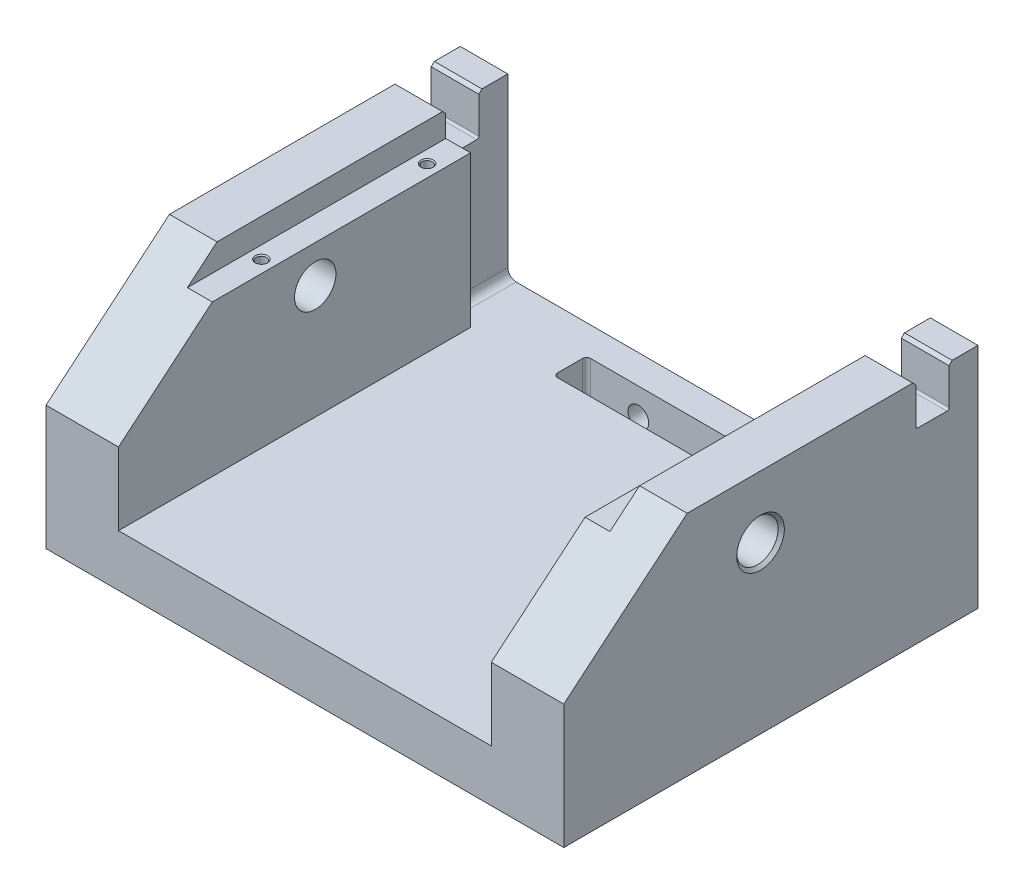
from build123d import *

# Parameters (mm, degrees)
BOSS_EXTRUDE1_DEPTH     = 100
CUT_EXTRUDE2_DEPTH      = 195.229245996
CUT_EXTRUDE2_DEPTH_BACK = 195.229245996
CUT_EXTRUDE3_DEPTH      = 195.229245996
CUT_EXTRUDE3_DEPTH_BACK = 195.229245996
SKETCH3_W               = 12
SKETCH3_H               = 12
SKETCH4_W               = 12
SKETCH4_H               = 30
CUT_EXTRUDE4_DEPTH      = 85
SKETCH5_W               = 23
SKETCH5_H               = 16
CUT_EXTRUDE5_DEPTH      = 20
SKETCH6_W               = 100
SKETCH6_H               = 16
CUT_EXTRUDE6_DEPTH      = 182.245689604
SKETCH8_R               = 2.5
CUT_EXTRUDE7_DEPTH      = 15
CHAMFER1_SIZE           = 0.5
SKETCH9_R               = 5
CUT_EXTRUDE8_DEPTH      = 40
FILLET1_R               = 1
FILLET2_R               = 2
FILLET3_R               = 4
CUT_EXTRUDE9_DEPTH      = 195.229245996
CUT_EXTRUDE9_DEPTH_BACK = 195.229245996
SKETCH10_R              = 10
CHAMFER2_SIZE           = 1.5
CHAMFER3_SIZE           = 1.5


with BuildPart() as part:
    # Sketch1 → Boss-Extrude1 (new, symmetric)
    with BuildSketch(Plane.XY):
        Polygon((-90, 110), (-90, 25), (90, 25), (90, 110), (125, 110), (125, 0), (-125, 0), (-125, 110), align=None)
    extrude(amount=BOSS_EXTRUDE1_DEPTH, both=True)

    # Sketch2 → Cut-Extrude2 (cut, two sides: drawn at the far end of the back side and taken through both)
    with BuildSketch(Plane(origin=(0, 0, 0), x_dir=(0, 0, -1), z_dir=(1, 0, 0)).offset(-CUT_EXTRUDE2_DEPTH_BACK)):
        Polygon((-427.569995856, -214.863862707), (-100, 60), (-40.41232037, 110), (287.157675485, 384.863862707), (-262.570049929, 1040.003854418), (-977.29772127, 440.276129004), align=None)
    extrude(amount=CUT_EXTRUDE2_DEPTH + CUT_EXTRUDE2_DEPTH_BACK, mode=Mode.SUBTRACT)

    # Sketch3 → Cut-Extrude3 (cut, two sides: drawn at the far end of the back side and taken through both)
    with BuildSketch(Plane.XY.offset(-CUT_EXTRUDE3_DEPTH_BACK)):
        with Locations((-96, 104)):
            Rectangle(SKETCH3_W, SKETCH3_H)
        with Locations((96, 104)):
            Rectangle(SKETCH3_W, SKETCH3_H)
    extrude(amount=CUT_EXTRUDE3_DEPTH + CUT_EXTRUDE3_DEPTH_BACK, mode=Mode.SUBTRACT)

    # Sketch4 → Cut-Extrude4 (cut)
    with BuildSketch(Plane(origin=(0, 110, 0), x_dir=(1, 0, 0), z_dir=(0, 1, 0))):
        with Locations((-96, 85)):
            Rectangle(SKETCH4_W, SKETCH4_H)
        with Locations((96, 85)):
            Rectangle(SKETCH4_W, SKETCH4_H)
    extrude(amount=-CUT_EXTRUDE4_DEPTH, mode=Mode.SUBTRACT)

    # Sketch5 → Cut-Extrude5 (cut)
    with BuildSketch(Plane(origin=(0, 110, 0), x_dir=(1, 0, 0), z_dir=(0, 1, 0))):
        with Locations((-113.5, 78)):
            Rectangle(SKETCH5_W, SKETCH5_H)
        with Locations((113.5, 78)):
            Rectangle(SKETCH5_W, SKETCH5_H)
    extrude(amount=-CUT_EXTRUDE5_DEPTH, mode=Mode.SUBTRACT)

    # Sketch6 → Cut-Extrude6 (cut, through all)
    with BuildSketch(Plane(origin=(0, 25, 0), x_dir=(1, 0, 0), z_dir=(0, 1, 0))):
        with Locations((0, 78)):
            Rectangle(SKETCH6_W, SKETCH6_H)
    extrude(amount=-CUT_EXTRUDE6_DEPTH, mode=Mode.SUBTRACT)

    # Sketch8 → Cut-Extrude7 (cut)
    with BuildSketch(Plane(origin=(0, 98, 0), x_dir=(1, 0, 0), z_dir=(0, 1, 0))):
        with Locations(Location((-96, 55, 0), (0, 0, 270))):
            Circle(SKETCH8_R)
        with Locations(Location((-96, -25, 0), (0, 0, 270))):
            Circle(SKETCH8_R)
        with Locations(Location((96, 55, 0), (0, 0, 270))):
            Circle(SKETCH8_R)
        with Locations(Location((96, -25, 0), (0, 0, 270))):
            Circle(SKETCH8_R)
    extrude(amount=-CUT_EXTRUDE7_DEPTH, mode=Mode.SUBTRACT)

    # Chamfer1
    chamfer1_edges = [part.edges().sort_by_distance(p)[0] for p in [
        (-96, 98, -57.5),
        (-96, 98, 22.5),
        (96, 98, -57.5),
        (96, 98, 22.5),
    ]]
    chamfer(chamfer1_edges, length=CHAMFER1_SIZE)

    # Sketch9 → Cut-Extrude8 (cut)
    with BuildSketch(Plane(origin=(0, 0, -100), x_dir=(-1, 0, 0), z_dir=(0, 0, -1))):
        with Locations((-25, 12)):
            Circle(SKETCH9_R)
        with Locations((25, 12)):
            Circle(SKETCH9_R)
    extrude(amount=-CUT_EXTRUDE8_DEPTH, mode=Mode.SUBTRACT)

    # Fillet1
    fillet1_edges = [part.edges().sort_by_distance(p)[0] for p in [
        (-113.5, 90, -70),
        (-113.5, 90, -86),
        (113.5, 90, -70),
        (113.5, 90, -86),
    ]]
    fillet(fillet1_edges, radius=FILLET1_R)

    # Fillet2
    fillet2_edges = [part.edges().sort_by_distance(p)[0] for p in [
        (-50, 12.5, -70),
        (-50, 12.5, -86),
        (50, 12.5, -86),
        (50, 12.5, -70),
    ]]
    fillet(fillet2_edges, radius=FILLET2_R)

    # Fillet3
    fillet3_edges = [part.edges().sort_by_distance(p)[0] for p in [
        (-102, 25, -85),
        (102, 25, -85),
    ]]
    fillet(fillet3_edges, radius=FILLET3_R)

    # Sketch10 → Cut-Extrude9 (cut, two sides: drawn at the far end of the back side and taken through both)
    with BuildSketch(Plane(origin=(0, 0, 0), x_dir=(0, 0, -1), z_dir=(1, 0, 0)).offset(-CUT_EXTRUDE9_DEPTH_BACK)):
        with Locations((-5, 80)):
            Circle(SKETCH10_R)
    extrude(amount=CUT_EXTRUDE9_DEPTH + CUT_EXTRUDE9_DEPTH_BACK, mode=Mode.SUBTRACT)

    # Chamfer2
    chamfer2_edges = [part.edges().sort_by_distance(p)[0] for p in [
        (-113.5, 110, -86),
        (-113.5, 110, -70),
        (113.5, 110, -70),
        (113.5, 110, -86),
    ]]
    chamfer(chamfer2_edges, length=CHAMFER2_SIZE)

    # Chamfer3
    chamfer3_edges = [part.edges().sort_by_distance(p)[0] for p in [
        (-125, 80, 15),
        (125, 80, 15),
    ]]
    chamfer(chamfer3_edges, length=CHAMFER3_SIZE)


solid = part.part
